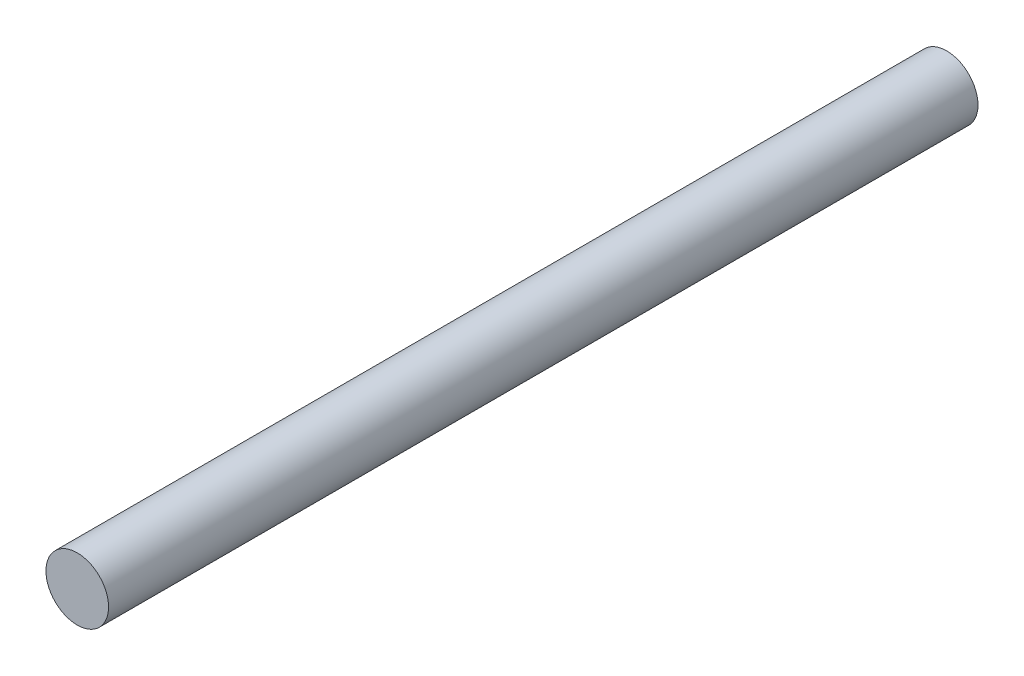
from build123d import *

# Parameters (mm, degrees)
ESQUISSE1_R        = 9
BOSS_EXTRU_1_DEPTH = 250


with BuildPart() as part:
    # Esquisse1 → Boss.-Extru.1 (new body)
    with BuildSketch(Plane.XY):
        Circle(ESQUISSE1_R)
    extrude(amount=BOSS_EXTRU_1_DEPTH)


solid = part.part
